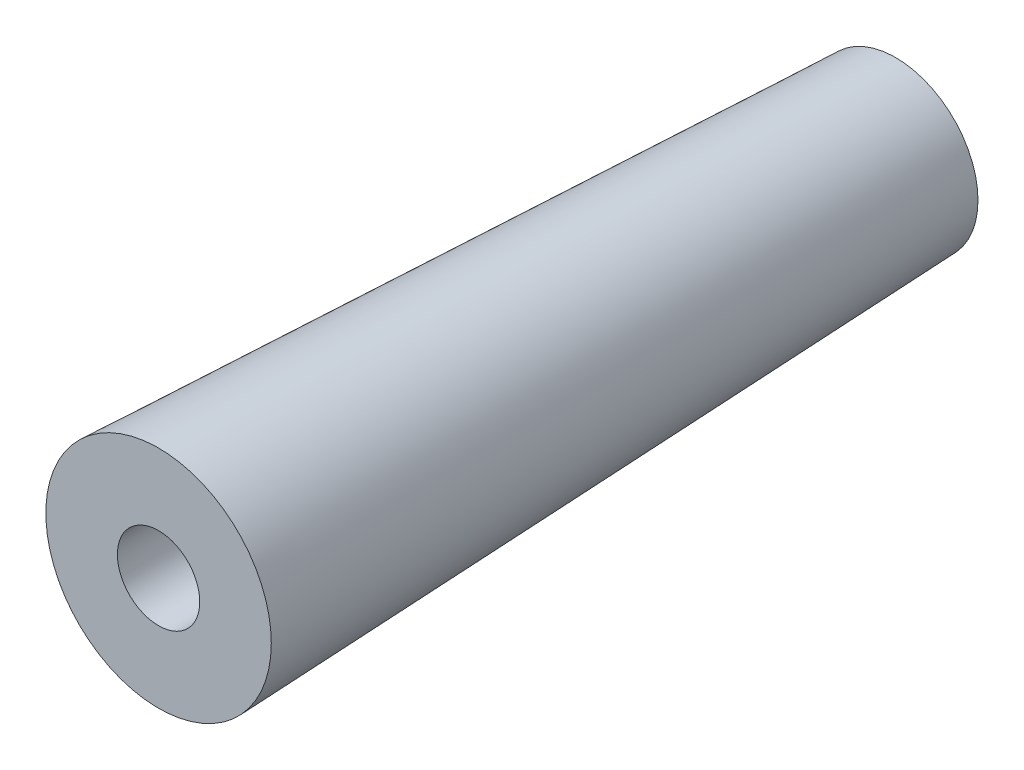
from build123d import *

# Parameters (mm, degrees)
SKETCH1_R          = 9.5
SKETCH2_R          = 13
SKETCH3_R          = 4.75
CUT_EXTRUDE1_DEPTH = 87.965510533


with BuildPart() as part:
    # Sketch1 → Base-Loft section 0
    with BuildSketch(Plane.XY):
        Circle(SKETCH1_R)
    # Sketch2 → Base-Loft section 1
    with BuildSketch(Plane.XY.offset(85)):
        Circle(SKETCH2_R)
    loft()

    # Sketch3 → Cut-Extrude1 (cut, through all)
    with BuildSketch(Plane.XY.offset(85)):
        Circle(SKETCH3_R)
    extrude(amount=-CUT_EXTRUDE1_DEPTH, mode=Mode.SUBTRACT)


solid = part.part
